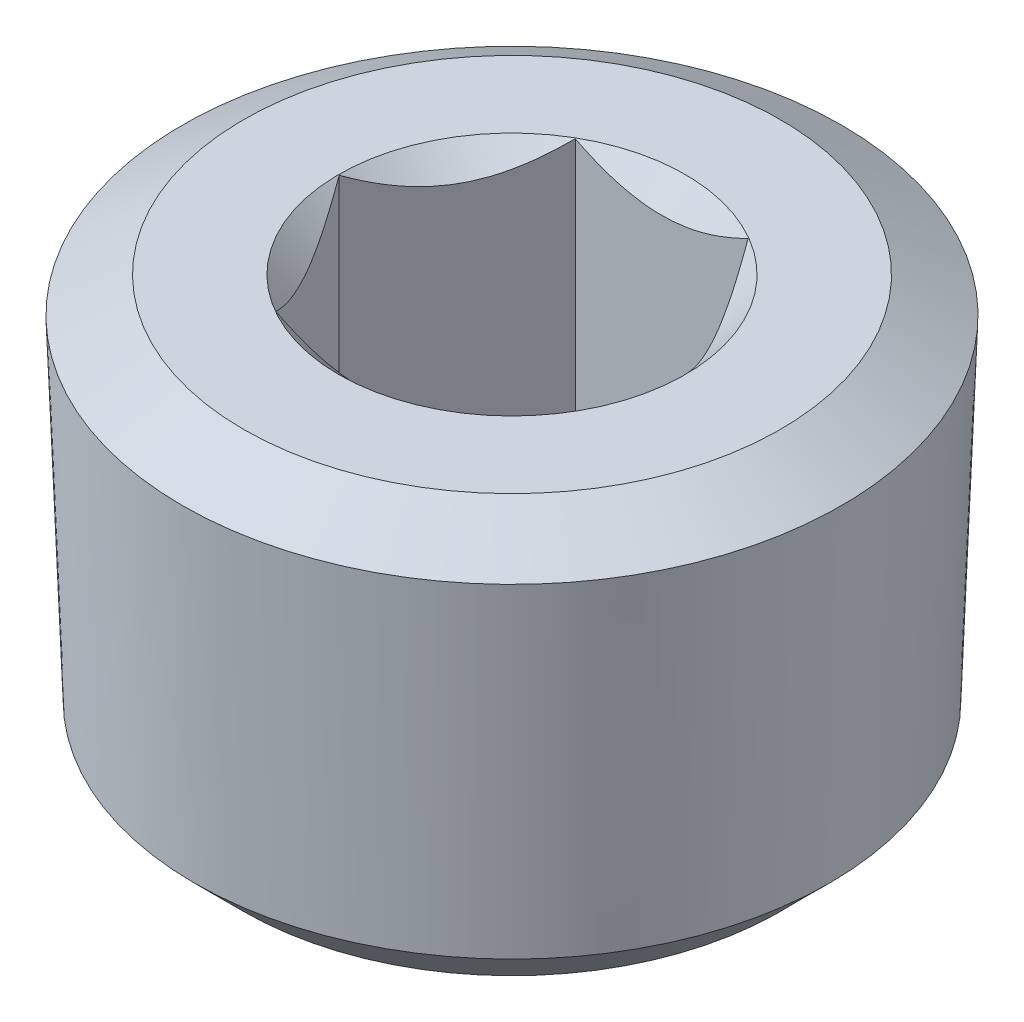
ISO-10303-21;
HEADER;
FILE_DESCRIPTION(('STEP AP214'),'2;1');
FILE_NAME('part.step','',(''),(''),'','','');
FILE_SCHEMA(('AUTOMOTIVE_DESIGN { 1 0 10303 214 1 1 1 1 }'));
ENDSEC;
DATA;
#1=APPLICATION_CONTEXT('core data for automotive mechanical design processes');
#2=APPLICATION_PROTOCOL_DEFINITION('international standard','automotive_design',2000,#1);
#3=PRODUCT_CONTEXT('',#1,'mechanical');
#4=PRODUCT('Part','Part','',(#3));
#5=PRODUCT_RELATED_PRODUCT_CATEGORY('part','',(#4));
#6=PRODUCT_DEFINITION_FORMATION('','',#4);
#7=PRODUCT_DEFINITION_CONTEXT('part definition',#1,'design');
#8=PRODUCT_DEFINITION('design','',#6,#7);
#9=PRODUCT_DEFINITION_SHAPE('','',#8);
#10=(LENGTH_UNIT() NAMED_UNIT(*) SI_UNIT(.MILLI.,.METRE.));
#11=(NAMED_UNIT(*) PLANE_ANGLE_UNIT() SI_UNIT($,.RADIAN.));
#12=(NAMED_UNIT(*) SI_UNIT($,.STERADIAN.) SOLID_ANGLE_UNIT());
#13=UNCERTAINTY_MEASURE_WITH_UNIT(LENGTH_MEASURE(1.E-05),#10,'distance_accuracy_value','');
#14=(GEOMETRIC_REPRESENTATION_CONTEXT(3) GLOBAL_UNCERTAINTY_ASSIGNED_CONTEXT((#13)) GLOBAL_UNIT_ASSIGNED_CONTEXT((#10,
#11,#12)) REPRESENTATION_CONTEXT('',''));
#15=CARTESIAN_POINT('',(0.,0.,0.));
#16=DIRECTION('',(0.,0.,1.));
#17=DIRECTION('',(1.,0.,0.));
#18=AXIS2_PLACEMENT_3D('',#15,#16,#17);
#19=CARTESIAN_POINT('',(0.,0.,0.));
#20=DIRECTION('',(0.,1.,0.));
#21=DIRECTION('',(0.,0.,1.));
#22=AXIS2_PLACEMENT_3D('',#19,#20,#21);
#23=PLANE('',#22);
#24=CARTESIAN_POINT('',(0.,0.,0.));
#25=DIRECTION('',(0.,1.,0.));
#26=DIRECTION('',(0.,0.,1.));
#27=AXIS2_PLACEMENT_3D('',#24,#25,#26);
#28=CIRCLE('',#27,5.588);
#29=CARTESIAN_POINT('',(0.,0.,5.588));
#30=VERTEX_POINT('',#29);
#31=EDGE_CURVE('E238',#30,#30,#28,.T.);
#32=ORIENTED_EDGE('',*,*,#31,.F.);
#33=EDGE_LOOP('',(#32));
#34=FACE_BOUND('',#33,.T.);
#35=CARTESIAN_POINT('',(0.,0.,0.));
#36=DIRECTION('',(0.,1.,0.));
#37=DIRECTION('',(0.,0.,1.));
#38=AXIS2_PLACEMENT_3D('',#35,#36,#37);
#39=CIRCLE('',#38,8.6531941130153);
#40=CARTESIAN_POINT('',(0.,0.,8.6531941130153));
#41=VERTEX_POINT('',#40);
#42=EDGE_CURVE('E12',#41,#41,#39,.T.);
#43=ORIENTED_EDGE('',*,*,#42,.T.);
#44=EDGE_LOOP('',(#43));
#45=FACE_BOUND('',#44,.T.);
#46=ADVANCED_FACE('F33',(#34,#45),#23,.T.);
#47=CARTESIAN_POINT('',(0.,0.,0.));
#48=DIRECTION('',(0.,-1.,0.));
#49=DIRECTION('',(0.,0.,-1.));
#50=AXIS2_PLACEMENT_3D('',#47,#48,#49);
#51=CONICAL_SURFACE('',#50,8.6531941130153,1.0471975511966);
#52=CARTESIAN_POINT('',(0.,-1.13926782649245,0.));
#53=DIRECTION('',(0.,1.,0.));
#54=DIRECTION('',(0.,0.,1.));
#55=AXIS2_PLACEMENT_3D('',#52,#53,#54);
#56=CIRCLE('',#55,10.6264638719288);
#57=CARTESIAN_POINT('',(0.,-1.13926782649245,10.6264638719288));
#58=VERTEX_POINT('',#57);
#59=EDGE_CURVE('E40',#58,#58,#56,.T.);
#60=ORIENTED_EDGE('',*,*,#59,.T.);
#61=EDGE_LOOP('',(#60));
#62=FACE_BOUND('',#61,.T.);
#63=ORIENTED_EDGE('',*,*,#42,.F.);
#64=EDGE_LOOP('',(#63));
#65=FACE_BOUND('',#64,.T.);
#66=ADVANCED_FACE('F228',(#62,#65),#51,.T.);
#67=CARTESIAN_POINT('',(0.,-1.13926782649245,0.));
#68=DIRECTION('',(0.,1.,0.));
#69=DIRECTION('',(0.,0.,1.));
#70=AXIS2_PLACEMENT_3D('',#67,#68,#69);
#71=CONICAL_SURFACE('',#70,10.6264638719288,0.0364424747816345);
#72=CARTESIAN_POINT('',(0.,-11.8803346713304,0.));
#73=DIRECTION('',(0.,1.,0.));
#74=DIRECTION('',(0.,0.,1.));
#75=AXIS2_PLACEMENT_3D('',#72,#73,#74);
#76=CIRCLE('',#75,10.2348594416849);
#77=CARTESIAN_POINT('',(0.,-11.8803346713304,10.2348594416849));
#78=VERTEX_POINT('',#77);
#79=EDGE_CURVE('E246',#78,#78,#76,.T.);
#80=ORIENTED_EDGE('',*,*,#79,.T.);
#81=EDGE_LOOP('',(#80));
#82=FACE_BOUND('',#81,.T.);
#83=ORIENTED_EDGE('',*,*,#59,.F.);
#84=EDGE_LOOP('',(#83));
#85=FACE_BOUND('',#84,.T.);
#86=ADVANCED_FACE('F233',(#82,#85),#71,.T.);
#87=CARTESIAN_POINT('',(0.,-11.8803346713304,0.));
#88=DIRECTION('',(0.,1.,0.));
#89=DIRECTION('',(0.,0.,1.));
#90=AXIS2_PLACEMENT_3D('',#87,#88,#89);
#91=CONICAL_SURFACE('',#90,10.2348594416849,0.785398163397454);
#92=CARTESIAN_POINT('',(0.,-13.462,0.));
#93=DIRECTION('',(0.,1.,0.));
#94=DIRECTION('',(0.,0.,1.));
#95=AXIS2_PLACEMENT_3D('',#92,#93,#94);
#96=CIRCLE('',#95,8.6531941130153);
#97=CARTESIAN_POINT('',(0.,-13.462,8.6531941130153));
#98=VERTEX_POINT('',#97);
#99=EDGE_CURVE('E242',#98,#98,#96,.T.);
#100=ORIENTED_EDGE('',*,*,#99,.T.);
#101=EDGE_LOOP('',(#100));
#102=FACE_BOUND('',#101,.T.);
#103=ORIENTED_EDGE('',*,*,#79,.F.);
#104=EDGE_LOOP('',(#103));
#105=FACE_BOUND('',#104,.T.);
#106=ADVANCED_FACE('F257',(#102,#105),#91,.T.);
#107=CARTESIAN_POINT('',(-8.6531941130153,-13.462,0.));
#108=DIRECTION('',(0.,-1.,0.));
#109=DIRECTION('',(0.,0.,-1.));
#110=AXIS2_PLACEMENT_3D('',#107,#108,#109);
#111=PLANE('',#110);
#112=ORIENTED_EDGE('',*,*,#99,.F.);
#113=EDGE_LOOP('',(#112));
#114=FACE_BOUND('',#113,.T.);
#115=ADVANCED_FACE('F175',(#114),#111,.T.);
#116=CARTESIAN_POINT('',(0.,0.,0.));
#117=DIRECTION('',(0.,1.,0.));
#118=DIRECTION('',(0.,0.,1.));
#119=AXIS2_PLACEMENT_3D('',#116,#117,#118);
#120=CONICAL_SURFACE('',#119,5.588,0.785398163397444);
#121=CARTESIAN_POINT('',(-5.82098732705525,1.97336029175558,4.826));
#122=CARTESIAN_POINT('',(-5.68037895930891,1.86513957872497,4.826));
#123=CARTESIAN_POINT('',(-5.53901367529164,1.75788686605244,4.826));
#124=CARTESIAN_POINT('',(-5.25445964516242,1.54575989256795,4.826));
#125=CARTESIAN_POINT('',(-5.11127047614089,1.44088619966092,4.826));
#126=CARTESIAN_POINT('',(-4.82171273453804,1.23321340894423,4.826));
#127=CARTESIAN_POINT('',(-4.67532815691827,1.13043655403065,4.826));
#128=CARTESIAN_POINT('',(-4.3801239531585,0.928453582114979,4.826));
#129=CARTESIAN_POINT('',(-4.23130449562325,0.829247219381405,4.826));
#130=CARTESIAN_POINT('',(-3.92127070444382,0.62905260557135,4.826));
#131=CARTESIAN_POINT('',(-3.75986976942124,0.528351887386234,4.826));
#132=CARTESIAN_POINT('',(-3.43327724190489,0.333192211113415,4.826));
#133=CARTESIAN_POINT('',(-3.26808501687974,0.238734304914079,4.826));
#134=CARTESIAN_POINT('',(-2.93386328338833,0.0580712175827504,4.826));
#135=CARTESIAN_POINT('',(-2.76484697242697,-0.0281581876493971,4.826));
#136=CARTESIAN_POINT('',(-2.42203255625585,-0.190432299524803,4.826));
#137=CARTESIAN_POINT('',(-2.24823675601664,-0.26648181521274,4.826));
#138=CARTESIAN_POINT('',(-1.9129593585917,-0.398742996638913,4.826));
#139=CARTESIAN_POINT('',(-1.75196353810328,-0.456173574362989,4.826));
#140=CARTESIAN_POINT('',(-1.42586489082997,-0.558148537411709,4.826));
#141=CARTESIAN_POINT('',(-1.26076180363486,-0.602692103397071,4.826));
#142=CARTESIAN_POINT('',(-0.930313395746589,-0.675737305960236,4.826));
#143=CARTESIAN_POINT('',(-0.765033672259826,-0.704530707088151,4.826));
#144=CARTESIAN_POINT('',(-0.432413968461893,-0.745473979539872,4.826));
#145=CARTESIAN_POINT('',(-0.265074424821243,-0.757627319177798,4.826));
#146=CARTESIAN_POINT('',(0.0626058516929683,-0.764252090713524,4.826));
#147=CARTESIAN_POINT('',(0.222931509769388,-0.759475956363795,4.826));
#148=CARTESIAN_POINT('',(0.542334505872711,-0.73423422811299,4.826));
#149=CARTESIAN_POINT('',(0.701411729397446,-0.713767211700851,4.826));
#150=CARTESIAN_POINT('',(1.01986275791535,-0.657954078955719,4.826));
#151=CARTESIAN_POINT('',(1.17918969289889,-0.622345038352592,4.826));
#152=CARTESIAN_POINT('',(1.49433390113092,-0.538225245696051,4.826));
#153=CARTESIAN_POINT('',(1.65015137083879,-0.489715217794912,4.826));
#154=CARTESIAN_POINT('',(1.96673903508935,-0.378863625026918,4.826));
#155=CARTESIAN_POINT('',(2.12728598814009,-0.315891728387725,4.826));
#156=CARTESIAN_POINT('',(2.44425109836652,-0.180218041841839,4.826));
#157=CARTESIAN_POINT('',(2.60066735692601,-0.107511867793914,4.826));
#158=CARTESIAN_POINT('',(2.91010924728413,0.0459062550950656,4.826));
#159=CARTESIAN_POINT('',(3.06312255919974,0.12664285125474,4.826));
#160=CARTESIAN_POINT('',(3.36564324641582,0.294345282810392,4.826));
#161=CARTESIAN_POINT('',(3.51515115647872,0.38131015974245,4.826));
#162=CARTESIAN_POINT('',(3.80381290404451,0.555835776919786,4.826));
#163=CARTESIAN_POINT('',(3.94311348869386,0.643155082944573,4.826));
#164=CARTESIAN_POINT('',(4.21932134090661,0.821511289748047,4.826));
#165=CARTESIAN_POINT('',(4.35622842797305,0.912548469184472,4.826));
#166=CARTESIAN_POINT('',(4.62686190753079,1.0969365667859,4.826));
#167=CARTESIAN_POINT('',(4.76060501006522,1.19026304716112,4.826));
#168=CARTESIAN_POINT('',(5.02625631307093,1.37941840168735,4.826));
#169=CARTESIAN_POINT('',(5.15816500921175,1.47524657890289,4.826));
#170=CARTESIAN_POINT('',(5.28930417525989,1.57209878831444,4.826));
#171=B_SPLINE_CURVE_WITH_KNOTS('',3,(#121,#122,#123,#124,#125,#126,#127,#128,#129,#130,#131,
#132,#133,#134,#135,#136,#137,#138,#139,#140,#141,#142,#143,#144,#145,#146,#147,#148,#149,#150,
#151,#152,#153,#154,#155,#156,#157,#158,#159,#160,#161,#162,#163,#164,#165,#166,#167,#168,#169,
#170),.UNSPECIFIED.,.F.,.F.,(4,2,2,2,2,2,2,2,2,2,2,2,2,2,2,2,2,2,2,2,2,2,2,2,4),(0.,
0.532308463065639,1.06474268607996,1.60128394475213,2.13778820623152,2.70839310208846,
3.27909389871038,3.8480591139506,4.41675459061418,4.92911037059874,5.44149871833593,
5.94404277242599,6.44648206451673,6.92687576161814,7.40731301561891,7.89645698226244,
8.38557349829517,8.90254275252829,9.41974562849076,9.93858801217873,10.4573507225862,
10.9504993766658,11.4436850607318,11.932911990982,12.4220040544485),.UNSPECIFIED.);
#172=CARTESIAN_POINT('',(2.78629239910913,-0.0154152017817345,4.826));
#173=VERTEX_POINT('',#172);
#174=CARTESIAN_POINT('',(-2.78629239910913,-0.0154152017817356,4.826));
#175=VERTEX_POINT('',#174);
#176=EDGE_CURVE('E47',#173,#175,#171,.F.);
#177=ORIENTED_EDGE('',*,*,#176,.T.);
#178=CARTESIAN_POINT('',(-2.78617692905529,-0.0152997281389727,4.8262));
#179=CARTESIAN_POINT('',(-2.83408610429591,-0.0632046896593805,4.74321887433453));
#180=CARTESIAN_POINT('',(-2.88236353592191,-0.109639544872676,4.65959990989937));
#181=CARTESIAN_POINT('',(-2.97972716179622,-0.199121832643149,4.49096116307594));
#182=CARTESIAN_POINT('',(-3.02881378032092,-0.242167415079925,4.4059406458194));
#183=CARTESIAN_POINT('',(-3.17785183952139,-0.365916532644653,4.14779915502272));
#184=CARTESIAN_POINT('',(-3.27906498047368,-0.440704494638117,3.97249285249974));
#185=CARTESIAN_POINT('',(-3.48316938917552,-0.568773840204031,3.61897364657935));
#186=CARTESIAN_POINT('',(-3.58600848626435,-0.622377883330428,3.44085110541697));
#187=CARTESIAN_POINT('',(-3.74195789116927,-0.684384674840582,3.17073881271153));
#188=CARTESIAN_POINT('',(-3.794170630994,-0.701978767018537,3.08030369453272));
#189=CARTESIAN_POINT('',(-3.8990382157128,-0.730635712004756,2.89866770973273));
#190=CARTESIAN_POINT('',(-3.95169299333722,-0.741699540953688,2.80746695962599));
#191=CARTESIAN_POINT('',(-4.08000416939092,-0.760249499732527,2.58522548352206));
#192=CARTESIAN_POINT('',(-4.15579881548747,-0.764141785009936,2.45394530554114));
#193=CARTESIAN_POINT('',(-4.30725151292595,-0.757609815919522,2.19162153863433));
#194=CARTESIAN_POINT('',(-4.38290950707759,-0.747180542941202,2.06057804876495));
#195=CARTESIAN_POINT('',(-4.53351221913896,-0.71262022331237,1.79972649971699));
#196=CARTESIAN_POINT('',(-4.60845604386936,-0.688473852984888,1.66991998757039));
#197=CARTESIAN_POINT('',(-4.75705559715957,-0.627792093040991,1.41253801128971));
#198=CARTESIAN_POINT('',(-4.8307114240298,-0.591257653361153,1.28496237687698));
#199=CARTESIAN_POINT('',(-4.96146614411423,-0.51609361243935,1.0584885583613));
#200=CARTESIAN_POINT('',(-5.01885452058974,-0.479440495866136,0.959088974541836));
#201=CARTESIAN_POINT('',(-5.13260104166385,-0.40022749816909,0.762074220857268));
#202=CARTESIAN_POINT('',(-5.18895915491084,-0.357667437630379,0.664459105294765));
#203=CARTESIAN_POINT('',(-5.30046764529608,-0.267594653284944,0.471320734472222));
#204=CARTESIAN_POINT('',(-5.35562119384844,-0.220097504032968,0.375791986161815));
#205=CARTESIAN_POINT('',(-5.46490695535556,-0.120774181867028,0.186503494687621));
#206=CARTESIAN_POINT('',(-5.5190397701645,-0.0689506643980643,0.092742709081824));
#207=CARTESIAN_POINT('',(-5.5727002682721,-0.0152997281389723,-0.000199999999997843));
#208=B_SPLINE_CURVE_WITH_KNOTS('',3,(#178,#179,#180,#181,#182,#183,#184,#185,#186,#187,#188,
#189,#190,#191,#192,#193,#194,#195,#196,#197,#198,#199,#200,#201,#202,#203,#204,#205,#206,#207),
.UNSPECIFIED.,.F.,.F.,(4,2,2,2,2,2,2,2,2,2,2,2,2,2,4),(0.,0.321360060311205,0.642894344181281,
1.28943446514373,1.92570770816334,2.24322028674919,2.56068539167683,3.01489632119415,
3.46926645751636,3.92414518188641,4.37898903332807,4.74028088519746,5.10158371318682,
5.46177950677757,5.82175582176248),.UNSPECIFIED.);
#209=CARTESIAN_POINT('',(-5.57258479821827,-0.0154152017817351,0.));
#210=VERTEX_POINT('',#209);
#211=EDGE_CURVE('E119',#175,#210,#208,.T.);
#212=ORIENTED_EDGE('',*,*,#211,.T.);
#213=CARTESIAN_POINT('',(-5.5727002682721,-0.0152997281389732,0.000200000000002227));
#214=CARTESIAN_POINT('',(-5.52479109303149,-0.0632046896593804,-0.0827811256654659));
#215=CARTESIAN_POINT('',(-5.47651366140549,-0.109639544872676,-0.16640009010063));
#216=CARTESIAN_POINT('',(-5.37915003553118,-0.199121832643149,-0.335038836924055));
#217=CARTESIAN_POINT('',(-5.33006341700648,-0.242167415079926,-0.420059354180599));
#218=CARTESIAN_POINT('',(-5.18102535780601,-0.365916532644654,-0.678200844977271));
#219=CARTESIAN_POINT('',(-5.07981221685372,-0.440704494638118,-0.853507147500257));
#220=CARTESIAN_POINT('',(-4.87570780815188,-0.568773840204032,-1.20702635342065));
#221=CARTESIAN_POINT('',(-4.77286871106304,-0.622377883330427,-1.38514889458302));
#222=CARTESIAN_POINT('',(-4.61691930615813,-0.684384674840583,-1.65526118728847));
#223=CARTESIAN_POINT('',(-4.5647065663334,-0.701978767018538,-1.74569630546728));
#224=CARTESIAN_POINT('',(-4.4598389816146,-0.730635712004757,-1.92733229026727));
#225=CARTESIAN_POINT('',(-4.40718420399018,-0.741699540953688,-2.01853304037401));
#226=CARTESIAN_POINT('',(-4.27887302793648,-0.760249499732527,-2.24077451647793));
#227=CARTESIAN_POINT('',(-4.20307838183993,-0.764141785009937,-2.37205469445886));
#228=CARTESIAN_POINT('',(-4.05162568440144,-0.757609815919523,-2.63437846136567));
#229=CARTESIAN_POINT('',(-3.97596769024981,-0.747180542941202,-2.76542195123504));
#230=CARTESIAN_POINT('',(-3.82536497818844,-0.71262022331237,-3.02627350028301));
#231=CARTESIAN_POINT('',(-3.75042115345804,-0.688473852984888,-3.15608001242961));
#232=CARTESIAN_POINT('',(-3.60182160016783,-0.627792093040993,-3.41346198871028));
#233=CARTESIAN_POINT('',(-3.5281657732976,-0.591257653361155,-3.54103762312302));
#234=CARTESIAN_POINT('',(-3.39741105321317,-0.516093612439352,-3.76751144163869));
#235=CARTESIAN_POINT('',(-3.34002267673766,-0.479440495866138,-3.86691102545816));
#236=CARTESIAN_POINT('',(-3.22627615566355,-0.400227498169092,-4.06392577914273));
#237=CARTESIAN_POINT('',(-3.16991804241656,-0.357667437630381,-4.16154089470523));
#238=CARTESIAN_POINT('',(-3.05840955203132,-0.267594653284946,-4.35467926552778));
#239=CARTESIAN_POINT('',(-3.00325600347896,-0.220097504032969,-4.45020801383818));
#240=CARTESIAN_POINT('',(-2.89397024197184,-0.120774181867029,-4.63949650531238));
#241=CARTESIAN_POINT('',(-2.8398374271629,-0.0689506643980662,-4.73325729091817));
#242=CARTESIAN_POINT('',(-2.7861769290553,-0.0152997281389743,-4.8262));
#243=B_SPLINE_CURVE_WITH_KNOTS('',3,(#213,#214,#215,#216,#217,#218,#219,#220,#221,#222,#223,
#224,#225,#226,#227,#228,#229,#230,#231,#232,#233,#234,#235,#236,#237,#238,#239,#240,#241,#242),
.UNSPECIFIED.,.F.,.F.,(4,2,2,2,2,2,2,2,2,2,2,2,2,2,4),(0.,0.321360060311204,0.642894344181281,
1.28943446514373,1.92570770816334,2.24322028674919,2.56068539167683,3.01489632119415,
3.46926645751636,3.92414518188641,4.37898903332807,4.74028088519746,5.10158371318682,
5.46177950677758,5.82175582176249),.UNSPECIFIED.);
#244=CARTESIAN_POINT('',(-2.78629239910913,-0.0154152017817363,-4.826));
#245=VERTEX_POINT('',#244);
#246=EDGE_CURVE('E197',#210,#245,#243,.T.);
#247=ORIENTED_EDGE('',*,*,#246,.T.);
#248=CARTESIAN_POINT('',(-5.82098732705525,1.97336029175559,-4.826));
#249=CARTESIAN_POINT('',(-5.68037895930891,1.86513957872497,-4.826));
#250=CARTESIAN_POINT('',(-5.53901367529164,1.75788686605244,-4.826));
#251=CARTESIAN_POINT('',(-5.25445964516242,1.54575989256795,-4.826));
#252=CARTESIAN_POINT('',(-5.11127047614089,1.44088619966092,-4.826));
#253=CARTESIAN_POINT('',(-4.82171273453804,1.23321340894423,-4.826));
#254=CARTESIAN_POINT('',(-4.67532815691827,1.13043655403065,-4.826));
#255=CARTESIAN_POINT('',(-4.3801239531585,0.928453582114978,-4.826));
#256=CARTESIAN_POINT('',(-4.23130449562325,0.829247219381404,-4.826));
#257=CARTESIAN_POINT('',(-3.92127070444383,0.629052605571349,-4.826));
#258=CARTESIAN_POINT('',(-3.75986976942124,0.528351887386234,-4.826));
#259=CARTESIAN_POINT('',(-3.43327724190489,0.333192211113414,-4.826));
#260=CARTESIAN_POINT('',(-3.26808501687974,0.238734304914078,-4.826));
#261=CARTESIAN_POINT('',(-2.93386328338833,0.0580712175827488,-4.826));
#262=CARTESIAN_POINT('',(-2.76484697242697,-0.0281581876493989,-4.826));
#263=CARTESIAN_POINT('',(-2.42203255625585,-0.190432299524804,-4.826));
#264=CARTESIAN_POINT('',(-2.24823675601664,-0.266481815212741,-4.826));
#265=CARTESIAN_POINT('',(-1.9129593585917,-0.398742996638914,-4.826));
#266=CARTESIAN_POINT('',(-1.75196353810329,-0.45617357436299,-4.826));
#267=CARTESIAN_POINT('',(-1.42586489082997,-0.558148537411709,-4.826));
#268=CARTESIAN_POINT('',(-1.26076180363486,-0.602692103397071,-4.826));
#269=CARTESIAN_POINT('',(-0.930313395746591,-0.675737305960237,-4.826));
#270=CARTESIAN_POINT('',(-0.765033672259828,-0.704530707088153,-4.826));
#271=CARTESIAN_POINT('',(-0.432413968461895,-0.745473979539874,-4.826));
#272=CARTESIAN_POINT('',(-0.265074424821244,-0.757627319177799,-4.826));
#273=CARTESIAN_POINT('',(0.0626058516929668,-0.764252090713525,-4.826));
#274=CARTESIAN_POINT('',(0.222931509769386,-0.759475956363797,-4.826));
#275=CARTESIAN_POINT('',(0.542334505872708,-0.734234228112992,-4.826));
#276=CARTESIAN_POINT('',(0.701411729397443,-0.713767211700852,-4.826));
#277=CARTESIAN_POINT('',(1.01986275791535,-0.657954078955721,-4.826));
#278=CARTESIAN_POINT('',(1.17918969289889,-0.622345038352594,-4.826));
#279=CARTESIAN_POINT('',(1.49433390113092,-0.538225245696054,-4.826));
#280=CARTESIAN_POINT('',(1.65015137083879,-0.489715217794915,-4.826));
#281=CARTESIAN_POINT('',(1.96673903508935,-0.378863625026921,-4.826));
#282=CARTESIAN_POINT('',(2.12728598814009,-0.315891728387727,-4.826));
#283=CARTESIAN_POINT('',(2.44425109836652,-0.180218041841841,-4.826));
#284=CARTESIAN_POINT('',(2.60066735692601,-0.107511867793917,-4.826));
#285=CARTESIAN_POINT('',(2.91010924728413,0.045906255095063,-4.826));
#286=CARTESIAN_POINT('',(3.06312255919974,0.126642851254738,-4.826));
#287=CARTESIAN_POINT('',(3.36564324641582,0.29434528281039,-4.826));
#288=CARTESIAN_POINT('',(3.51515115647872,0.381310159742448,-4.826));
#289=CARTESIAN_POINT('',(3.80381290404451,0.555835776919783,-4.826));
#290=CARTESIAN_POINT('',(3.94311348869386,0.64315508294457,-4.826));
#291=CARTESIAN_POINT('',(4.21932134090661,0.821511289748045,-4.826));
#292=CARTESIAN_POINT('',(4.35622842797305,0.912548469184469,-4.826));
#293=CARTESIAN_POINT('',(4.62686190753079,1.09693656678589,-4.826));
#294=CARTESIAN_POINT('',(4.76060501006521,1.19026304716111,-4.826));
#295=CARTESIAN_POINT('',(5.02625631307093,1.37941840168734,-4.826));
#296=CARTESIAN_POINT('',(5.15816500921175,1.47524657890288,-4.826));
#297=CARTESIAN_POINT('',(5.28930417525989,1.57209878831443,-4.826));
#298=B_SPLINE_CURVE_WITH_KNOTS('',3,(#248,#249,#250,#251,#252,#253,#254,#255,#256,#257,#258,
#259,#260,#261,#262,#263,#264,#265,#266,#267,#268,#269,#270,#271,#272,#273,#274,#275,#276,#277,
#278,#279,#280,#281,#282,#283,#284,#285,#286,#287,#288,#289,#290,#291,#292,#293,#294,#295,#296,
#297),.UNSPECIFIED.,.F.,.F.,(4,2,2,2,2,2,2,2,2,2,2,2,2,2,2,2,2,2,2,2,2,2,2,2,4),(0.,
0.532308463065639,1.06474268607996,1.60128394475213,2.13778820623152,2.70839310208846,
3.27909389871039,3.84805911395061,4.41675459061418,4.92911037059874,5.44149871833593,
5.94404277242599,6.44648206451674,6.92687576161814,7.40731301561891,7.89645698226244,
8.38557349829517,8.90254275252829,9.41974562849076,9.93858801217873,10.4573507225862,
10.9504993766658,11.4436850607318,11.932911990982,12.4220040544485),.UNSPECIFIED.);
#299=CARTESIAN_POINT('',(2.78629239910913,-0.015415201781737,-4.826));
#300=VERTEX_POINT('',#299);
#301=EDGE_CURVE('E191',#245,#300,#298,.T.);
#302=ORIENTED_EDGE('',*,*,#301,.T.);
#303=CARTESIAN_POINT('',(2.78617692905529,-0.0152997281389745,-4.8262));
#304=CARTESIAN_POINT('',(2.83408610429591,-0.0632046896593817,-4.74321887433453));
#305=CARTESIAN_POINT('',(2.88236353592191,-0.109639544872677,-4.65959990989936));
#306=CARTESIAN_POINT('',(2.97972716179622,-0.19912183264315,-4.49096116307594));
#307=CARTESIAN_POINT('',(3.02881378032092,-0.242167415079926,-4.4059406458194));
#308=CARTESIAN_POINT('',(3.17785183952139,-0.365916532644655,-4.14779915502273));
#309=CARTESIAN_POINT('',(3.27906498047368,-0.440704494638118,-3.97249285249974));
#310=CARTESIAN_POINT('',(3.48316938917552,-0.568773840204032,-3.61897364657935));
#311=CARTESIAN_POINT('',(3.58600848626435,-0.622377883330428,-3.44085110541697));
#312=CARTESIAN_POINT('',(3.74195789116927,-0.684384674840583,-3.17073881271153));
#313=CARTESIAN_POINT('',(3.794170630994,-0.701978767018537,-3.08030369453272));
#314=CARTESIAN_POINT('',(3.8990382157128,-0.730635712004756,-2.89866770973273));
#315=CARTESIAN_POINT('',(3.95169299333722,-0.741699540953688,-2.80746695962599));
#316=CARTESIAN_POINT('',(4.08000416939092,-0.760249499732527,-2.58522548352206));
#317=CARTESIAN_POINT('',(4.15579881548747,-0.764141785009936,-2.45394530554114));
#318=CARTESIAN_POINT('',(4.30725151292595,-0.757609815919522,-2.19162153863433));
#319=CARTESIAN_POINT('',(4.38290950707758,-0.747180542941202,-2.06057804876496));
#320=CARTESIAN_POINT('',(4.53351221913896,-0.712620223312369,-1.79972649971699));
#321=CARTESIAN_POINT('',(4.60845604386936,-0.688473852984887,-1.66991998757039));
#322=CARTESIAN_POINT('',(4.75705559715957,-0.627792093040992,-1.41253801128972));
#323=CARTESIAN_POINT('',(4.8307114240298,-0.591257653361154,-1.28496237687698));
#324=CARTESIAN_POINT('',(4.96146614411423,-0.516093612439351,-1.0584885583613));
#325=CARTESIAN_POINT('',(5.01885452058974,-0.479440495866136,-0.959088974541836));
#326=CARTESIAN_POINT('',(5.13260104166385,-0.40022749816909,-0.762074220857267));
#327=CARTESIAN_POINT('',(5.18895915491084,-0.357667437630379,-0.664459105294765));
#328=CARTESIAN_POINT('',(5.30046764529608,-0.267594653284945,-0.471320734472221));
#329=CARTESIAN_POINT('',(5.35562119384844,-0.220097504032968,-0.375791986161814));
#330=CARTESIAN_POINT('',(5.46490695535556,-0.120774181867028,-0.18650349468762));
#331=CARTESIAN_POINT('',(5.5190397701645,-0.0689506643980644,-0.0927427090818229));
#332=CARTESIAN_POINT('',(5.5727002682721,-0.0152997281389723,0.000199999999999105));
#333=B_SPLINE_CURVE_WITH_KNOTS('',3,(#303,#304,#305,#306,#307,#308,#309,#310,#311,#312,#313,
#314,#315,#316,#317,#318,#319,#320,#321,#322,#323,#324,#325,#326,#327,#328,#329,#330,#331,#332),
.UNSPECIFIED.,.F.,.F.,(4,2,2,2,2,2,2,2,2,2,2,2,2,2,4),(0.,0.321360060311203,0.642894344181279,
1.28943446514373,1.92570770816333,2.24322028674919,2.56068539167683,3.01489632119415,
3.46926645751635,3.9241451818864,4.37898903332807,4.74028088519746,5.10158371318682,
5.46177950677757,5.82175582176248),.UNSPECIFIED.);
#334=CARTESIAN_POINT('',(5.57258479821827,-0.0154152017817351,0.));
#335=VERTEX_POINT('',#334);
#336=EDGE_CURVE('E185',#300,#335,#333,.T.);
#337=ORIENTED_EDGE('',*,*,#336,.T.);
#338=CARTESIAN_POINT('',(5.5727002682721,-0.0152997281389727,-0.000200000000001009));
#339=CARTESIAN_POINT('',(5.52479109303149,-0.0632046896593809,0.0827811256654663));
#340=CARTESIAN_POINT('',(5.47651366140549,-0.109639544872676,0.166400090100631));
#341=CARTESIAN_POINT('',(5.37915003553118,-0.199121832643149,0.335038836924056));
#342=CARTESIAN_POINT('',(5.33006341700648,-0.242167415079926,0.4200593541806));
#343=CARTESIAN_POINT('',(5.18102535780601,-0.365916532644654,0.678200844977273));
#344=CARTESIAN_POINT('',(5.07981221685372,-0.440704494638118,0.853507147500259));
#345=CARTESIAN_POINT('',(4.87570780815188,-0.568773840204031,1.20702635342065));
#346=CARTESIAN_POINT('',(4.77286871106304,-0.622377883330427,1.38514889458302));
#347=CARTESIAN_POINT('',(4.61691930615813,-0.684384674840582,1.65526118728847));
#348=CARTESIAN_POINT('',(4.5647065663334,-0.701978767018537,1.74569630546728));
#349=CARTESIAN_POINT('',(4.4598389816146,-0.730635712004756,1.92733229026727));
#350=CARTESIAN_POINT('',(4.40718420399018,-0.741699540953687,2.01853304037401));
#351=CARTESIAN_POINT('',(4.27887302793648,-0.760249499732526,2.24077451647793));
#352=CARTESIAN_POINT('',(4.20307838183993,-0.764141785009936,2.37205469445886));
#353=CARTESIAN_POINT('',(4.05162568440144,-0.757609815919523,2.63437846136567));
#354=CARTESIAN_POINT('',(3.97596769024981,-0.747180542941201,2.76542195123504));
#355=CARTESIAN_POINT('',(3.82536497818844,-0.712620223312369,3.026273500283));
#356=CARTESIAN_POINT('',(3.75042115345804,-0.688473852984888,3.1560800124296));
#357=CARTESIAN_POINT('',(3.60182160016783,-0.627792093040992,3.41346198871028));
#358=CARTESIAN_POINT('',(3.5281657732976,-0.591257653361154,3.54103762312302));
#359=CARTESIAN_POINT('',(3.39741105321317,-0.516093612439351,3.76751144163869));
#360=CARTESIAN_POINT('',(3.34002267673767,-0.479440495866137,3.86691102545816));
#361=CARTESIAN_POINT('',(3.22627615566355,-0.400227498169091,4.06392577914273));
#362=CARTESIAN_POINT('',(3.16991804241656,-0.35766743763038,4.16154089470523));
#363=CARTESIAN_POINT('',(3.05840955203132,-0.267594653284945,4.35467926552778));
#364=CARTESIAN_POINT('',(3.00325600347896,-0.220097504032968,4.45020801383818));
#365=CARTESIAN_POINT('',(2.89397024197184,-0.120774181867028,4.63949650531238));
#366=CARTESIAN_POINT('',(2.8398374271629,-0.0689506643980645,4.73325729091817));
#367=CARTESIAN_POINT('',(2.7861769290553,-0.0152997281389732,4.8262));
#368=B_SPLINE_CURVE_WITH_KNOTS('',3,(#338,#339,#340,#341,#342,#343,#344,#345,#346,#347,#348,
#349,#350,#351,#352,#353,#354,#355,#356,#357,#358,#359,#360,#361,#362,#363,#364,#365,#366,#367),
.UNSPECIFIED.,.F.,.F.,(4,2,2,2,2,2,2,2,2,2,2,2,2,2,4),(0.,0.321360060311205,0.642894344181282,
1.28943446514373,1.92570770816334,2.24322028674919,2.56068539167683,3.01489632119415,
3.46926645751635,3.9241451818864,4.37898903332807,4.74028088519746,5.10158371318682,
5.46177950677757,5.82175582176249),.UNSPECIFIED.);
#369=EDGE_CURVE('E162',#335,#173,#368,.T.);
#370=ORIENTED_EDGE('',*,*,#369,.T.);
#371=EDGE_LOOP('',(#177,#212,#247,#302,#337,#370));
#372=FACE_BOUND('',#371,.T.);
#373=ORIENTED_EDGE('',*,*,#31,.T.);
#374=EDGE_LOOP('',(#373));
#375=FACE_BOUND('',#374,.T.);
#376=ADVANCED_FACE('F170',(#372,#375),#120,.F.);
#377=CARTESIAN_POINT('',(-5.57258479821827,-8.89,0.));
#378=DIRECTION('',(-0.866025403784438,0.,0.5));
#379=DIRECTION('',(0.5,0.,0.866025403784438));
#380=AXIS2_PLACEMENT_3D('',#377,#378,#379);
#381=PLANE('',#380);
#382=DIRECTION('',(0.,1.,0.));
#383=VECTOR('',#382,1.);
#384=CARTESIAN_POINT('',(-2.78629239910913,-8.89,4.826));
#385=LINE('',#384,#383);
#386=CARTESIAN_POINT('',(-2.78629239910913,-8.89,4.826));
#387=VERTEX_POINT('',#386);
#388=EDGE_CURVE('E116',#387,#175,#385,.T.);
#389=ORIENTED_EDGE('',*,*,#388,.F.);
#390=DIRECTION('',(0.5,0.,0.866025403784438));
#391=VECTOR('',#390,1.);
#392=CARTESIAN_POINT('',(-5.57258479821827,-8.89,0.));
#393=LINE('',#392,#391);
#394=CARTESIAN_POINT('',(-4.1794385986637,-8.89,2.413));
#395=VERTEX_POINT('',#394);
#396=EDGE_CURVE('E103',#395,#387,#393,.T.);
#397=ORIENTED_EDGE('',*,*,#396,.F.);
#398=CARTESIAN_POINT('',(-5.57258479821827,-8.89,0.));
#399=VERTEX_POINT('',#398);
#400=EDGE_CURVE('E113',#399,#395,#393,.T.);
#401=ORIENTED_EDGE('',*,*,#400,.F.);
#402=DIRECTION('',(0.,1.,0.));
#403=VECTOR('',#402,1.);
#404=CARTESIAN_POINT('',(-5.57258479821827,-8.89,0.));
#405=LINE('',#404,#403);
#406=EDGE_CURVE('E143',#399,#210,#405,.T.);
#407=ORIENTED_EDGE('',*,*,#406,.T.);
#408=ORIENTED_EDGE('',*,*,#211,.F.);
#409=EDGE_LOOP('',(#389,#397,#401,#407,#408));
#410=FACE_BOUND('',#409,.T.);
#411=ADVANCED_FACE('F117',(#410),#381,.F.);
#412=CARTESIAN_POINT('',(-2.78629239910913,-8.89,-4.826));
#413=DIRECTION('',(-0.866025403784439,0.,-0.5));
#414=DIRECTION('',(-0.5,0.,0.866025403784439));
#415=AXIS2_PLACEMENT_3D('',#412,#413,#414);
#416=PLANE('',#415);
#417=ORIENTED_EDGE('',*,*,#406,.F.);
#418=DIRECTION('',(-0.5,0.,0.866025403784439));
#419=VECTOR('',#418,1.);
#420=CARTESIAN_POINT('',(-2.78629239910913,-8.89,-4.826));
#421=LINE('',#420,#419);
#422=CARTESIAN_POINT('',(-4.1794385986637,-8.89,-2.413));
#423=VERTEX_POINT('',#422);
#424=EDGE_CURVE('E140',#423,#399,#421,.T.);
#425=ORIENTED_EDGE('',*,*,#424,.F.);
#426=CARTESIAN_POINT('',(-2.78629239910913,-8.89,-4.826));
#427=VERTEX_POINT('',#426);
#428=EDGE_CURVE('E122',#427,#423,#421,.T.);
#429=ORIENTED_EDGE('',*,*,#428,.F.);
#430=DIRECTION('',(0.,1.,0.));
#431=VECTOR('',#430,1.);
#432=CARTESIAN_POINT('',(-2.78629239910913,-8.89,-4.826));
#433=LINE('',#432,#431);
#434=EDGE_CURVE('E145',#427,#245,#433,.T.);
#435=ORIENTED_EDGE('',*,*,#434,.T.);
#436=ORIENTED_EDGE('',*,*,#246,.F.);
#437=EDGE_LOOP('',(#417,#425,#429,#435,#436));
#438=FACE_BOUND('',#437,.T.);
#439=ADVANCED_FACE('F206',(#438),#416,.F.);
#440=CARTESIAN_POINT('',(2.78629239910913,-8.89,-4.826));
#441=DIRECTION('',(0.,0.,-1.));
#442=DIRECTION('',(-1.,0.,0.));
#443=AXIS2_PLACEMENT_3D('',#440,#441,#442);
#444=PLANE('',#443);
#445=ORIENTED_EDGE('',*,*,#434,.F.);
#446=DIRECTION('',(-1.,0.,0.));
#447=VECTOR('',#446,1.);
#448=CARTESIAN_POINT('',(2.78629239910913,-8.89,-4.826));
#449=LINE('',#448,#447);
#450=CARTESIAN_POINT('',(0.,-8.89,-4.826));
#451=VERTEX_POINT('',#450);
#452=EDGE_CURVE('E136',#451,#427,#449,.T.);
#453=ORIENTED_EDGE('',*,*,#452,.F.);
#454=CARTESIAN_POINT('',(2.78629239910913,-8.89,-4.826));
#455=VERTEX_POINT('',#454);
#456=EDGE_CURVE('E137',#455,#451,#449,.T.);
#457=ORIENTED_EDGE('',*,*,#456,.F.);
#458=DIRECTION('',(0.,1.,0.));
#459=VECTOR('',#458,1.);
#460=CARTESIAN_POINT('',(2.78629239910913,-8.89,-4.826));
#461=LINE('',#460,#459);
#462=EDGE_CURVE('E148',#455,#300,#461,.T.);
#463=ORIENTED_EDGE('',*,*,#462,.T.);
#464=ORIENTED_EDGE('',*,*,#301,.F.);
#465=EDGE_LOOP('',(#445,#453,#457,#463,#464));
#466=FACE_BOUND('',#465,.T.);
#467=ADVANCED_FACE('F210',(#466),#444,.F.);
#468=CARTESIAN_POINT('',(5.57258479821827,-8.89,0.));
#469=DIRECTION('',(0.866025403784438,0.,-0.5));
#470=DIRECTION('',(-0.5,0.,-0.866025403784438));
#471=AXIS2_PLACEMENT_3D('',#468,#469,#470);
#472=PLANE('',#471);
#473=ORIENTED_EDGE('',*,*,#462,.F.);
#474=DIRECTION('',(-0.5,0.,-0.866025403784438));
#475=VECTOR('',#474,1.);
#476=CARTESIAN_POINT('',(5.57258479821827,-8.89,0.));
#477=LINE('',#476,#475);
#478=CARTESIAN_POINT('',(4.1794385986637,-8.89,-2.413));
#479=VERTEX_POINT('',#478);
#480=EDGE_CURVE('E132',#479,#455,#477,.T.);
#481=ORIENTED_EDGE('',*,*,#480,.F.);
#482=CARTESIAN_POINT('',(5.57258479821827,-8.89,0.));
#483=VERTEX_POINT('',#482);
#484=EDGE_CURVE('E133',#483,#479,#477,.T.);
#485=ORIENTED_EDGE('',*,*,#484,.F.);
#486=DIRECTION('',(0.,1.,0.));
#487=VECTOR('',#486,1.);
#488=CARTESIAN_POINT('',(5.57258479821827,-8.89,0.));
#489=LINE('',#488,#487);
#490=EDGE_CURVE('E151',#483,#335,#489,.T.);
#491=ORIENTED_EDGE('',*,*,#490,.T.);
#492=ORIENTED_EDGE('',*,*,#336,.F.);
#493=EDGE_LOOP('',(#473,#481,#485,#491,#492));
#494=FACE_BOUND('',#493,.T.);
#495=ADVANCED_FACE('F214',(#494),#472,.F.);
#496=CARTESIAN_POINT('',(2.78629239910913,-8.89,4.826));
#497=DIRECTION('',(0.866025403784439,0.,0.5));
#498=DIRECTION('',(0.5,0.,-0.866025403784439));
#499=AXIS2_PLACEMENT_3D('',#496,#497,#498);
#500=PLANE('',#499);
#501=ORIENTED_EDGE('',*,*,#490,.F.);
#502=DIRECTION('',(0.5,0.,-0.866025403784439));
#503=VECTOR('',#502,1.);
#504=CARTESIAN_POINT('',(2.78629239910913,-8.89,4.826));
#505=LINE('',#504,#503);
#506=CARTESIAN_POINT('',(4.1794385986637,-8.89,2.413));
#507=VERTEX_POINT('',#506);
#508=EDGE_CURVE('E128',#507,#483,#505,.T.);
#509=ORIENTED_EDGE('',*,*,#508,.F.);
#510=CARTESIAN_POINT('',(2.78629239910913,-8.89,4.826));
#511=VERTEX_POINT('',#510);
#512=EDGE_CURVE('E55',#511,#507,#505,.T.);
#513=ORIENTED_EDGE('',*,*,#512,.F.);
#514=DIRECTION('',(0.,1.,0.));
#515=VECTOR('',#514,1.);
#516=CARTESIAN_POINT('',(2.78629239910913,-8.89,4.826));
#517=LINE('',#516,#515);
#518=EDGE_CURVE('E121',#511,#173,#517,.T.);
#519=ORIENTED_EDGE('',*,*,#518,.T.);
#520=ORIENTED_EDGE('',*,*,#369,.F.);
#521=EDGE_LOOP('',(#501,#509,#513,#519,#520));
#522=FACE_BOUND('',#521,.T.);
#523=ADVANCED_FACE('F218',(#522),#500,.F.);
#524=CARTESIAN_POINT('',(-2.78629239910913,-8.89,4.826));
#525=DIRECTION('',(0.,0.,1.));
#526=DIRECTION('',(1.,0.,0.));
#527=AXIS2_PLACEMENT_3D('',#524,#525,#526);
#528=PLANE('',#527);
#529=ORIENTED_EDGE('',*,*,#518,.F.);
#530=DIRECTION('',(1.,0.,0.));
#531=VECTOR('',#530,1.);
#532=CARTESIAN_POINT('',(-2.78629239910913,-8.89,4.826));
#533=LINE('',#532,#531);
#534=CARTESIAN_POINT('',(0.,-8.89,4.826));
#535=VERTEX_POINT('',#534);
#536=EDGE_CURVE('E127',#535,#511,#533,.T.);
#537=ORIENTED_EDGE('',*,*,#536,.F.);
#538=EDGE_CURVE('E107',#387,#535,#533,.T.);
#539=ORIENTED_EDGE('',*,*,#538,.F.);
#540=ORIENTED_EDGE('',*,*,#388,.T.);
#541=ORIENTED_EDGE('',*,*,#176,.F.);
#542=EDGE_LOOP('',(#529,#537,#539,#540,#541));
#543=FACE_BOUND('',#542,.T.);
#544=ADVANCED_FACE('F126',(#543),#528,.F.);
#545=CARTESIAN_POINT('',(0.,-8.89,0.));
#546=DIRECTION('',(0.,1.,0.));
#547=DIRECTION('',(0.,0.,1.));
#548=AXIS2_PLACEMENT_3D('',#545,#546,#547);
#549=PLANE('',#548);
#550=CARTESIAN_POINT('',(0.,-8.89,0.));
#551=DIRECTION('',(0.,1.,0.));
#552=DIRECTION('',(0.,0.,1.));
#553=AXIS2_PLACEMENT_3D('',#550,#551,#552);
#554=CIRCLE('',#553,4.826);
#555=EDGE_CURVE('E109',#395,#535,#554,.T.);
#556=ORIENTED_EDGE('',*,*,#555,.F.);
#557=ORIENTED_EDGE('',*,*,#396,.T.);
#558=ORIENTED_EDGE('',*,*,#538,.T.);
#559=EDGE_LOOP('',(#556,#557,#558));
#560=FACE_BOUND('',#559,.T.);
#561=ADVANCED_FACE('F105',(#560),#549,.T.);
#562=EDGE_CURVE('E408',#423,#395,#554,.T.);
#563=ORIENTED_EDGE('',*,*,#562,.F.);
#564=ORIENTED_EDGE('',*,*,#424,.T.);
#565=ORIENTED_EDGE('',*,*,#400,.T.);
#566=EDGE_LOOP('',(#563,#564,#565));
#567=FACE_BOUND('',#566,.T.);
#568=ADVANCED_FACE('F314',(#567),#549,.T.);
#569=EDGE_CURVE('E419',#451,#423,#554,.T.);
#570=ORIENTED_EDGE('',*,*,#569,.F.);
#571=ORIENTED_EDGE('',*,*,#452,.T.);
#572=ORIENTED_EDGE('',*,*,#428,.T.);
#573=EDGE_LOOP('',(#570,#571,#572));
#574=FACE_BOUND('',#573,.T.);
#575=ADVANCED_FACE('F323',(#574),#549,.T.);
#576=EDGE_CURVE('E420',#479,#451,#554,.T.);
#577=ORIENTED_EDGE('',*,*,#576,.F.);
#578=ORIENTED_EDGE('',*,*,#480,.T.);
#579=ORIENTED_EDGE('',*,*,#456,.T.);
#580=EDGE_LOOP('',(#577,#578,#579));
#581=FACE_BOUND('',#580,.T.);
#582=ADVANCED_FACE('F332',(#581),#549,.T.);
#583=EDGE_CURVE('E249',#507,#479,#554,.T.);
#584=ORIENTED_EDGE('',*,*,#583,.F.);
#585=ORIENTED_EDGE('',*,*,#508,.T.);
#586=ORIENTED_EDGE('',*,*,#484,.T.);
#587=EDGE_LOOP('',(#584,#585,#586));
#588=FACE_BOUND('',#587,.T.);
#589=ADVANCED_FACE('F341',(#588),#549,.T.);
#590=EDGE_CURVE('E243',#535,#507,#554,.T.);
#591=ORIENTED_EDGE('',*,*,#590,.F.);
#592=ORIENTED_EDGE('',*,*,#536,.T.);
#593=ORIENTED_EDGE('',*,*,#512,.T.);
#594=EDGE_LOOP('',(#591,#592,#593));
#595=FACE_BOUND('',#594,.T.);
#596=ADVANCED_FACE('F315',(#595),#549,.T.);
#597=CARTESIAN_POINT('',(-2.71236505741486,-10.16,0.));
#598=DIRECTION('',(0.,-1.,0.));
#599=DIRECTION('',(0.,0.,-1.));
#600=AXIS2_PLACEMENT_3D('',#597,#598,#599);
#601=PLANE('',#600);
#602=CARTESIAN_POINT('',(0.,-10.16,0.));
#603=DIRECTION('',(0.,1.,0.));
#604=DIRECTION('',(0.,0.,1.));
#605=AXIS2_PLACEMENT_3D('',#602,#603,#604);
#606=CIRCLE('',#605,2.71236505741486);
#607=CARTESIAN_POINT('',(0.,-10.16,2.71236505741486));
#608=VERTEX_POINT('',#607);
#609=EDGE_CURVE('E407',#608,#608,#606,.T.);
#610=ORIENTED_EDGE('',*,*,#609,.T.);
#611=EDGE_LOOP('',(#610));
#612=FACE_BOUND('',#611,.T.);
#613=ADVANCED_FACE('F358',(#612),#601,.F.);
#614=CARTESIAN_POINT('',(0.,-8.89,0.));
#615=DIRECTION('',(0.,1.,0.));
#616=DIRECTION('',(0.,0.,1.));
#617=AXIS2_PLACEMENT_3D('',#614,#615,#616);
#618=CONICAL_SURFACE('',#617,4.826,1.02974425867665);
#619=ORIENTED_EDGE('',*,*,#609,.F.);
#620=EDGE_LOOP('',(#619));
#621=FACE_BOUND('',#620,.T.);
#622=ORIENTED_EDGE('',*,*,#590,.T.);
#623=ORIENTED_EDGE('',*,*,#583,.T.);
#624=ORIENTED_EDGE('',*,*,#576,.T.);
#625=ORIENTED_EDGE('',*,*,#569,.T.);
#626=ORIENTED_EDGE('',*,*,#562,.T.);
#627=ORIENTED_EDGE('',*,*,#555,.T.);
#628=EDGE_LOOP('',(#622,#623,#624,#625,#626,#627));
#629=FACE_BOUND('',#628,.T.);
#630=ADVANCED_FACE('F176',(#621,#629),#618,.F.);
#631=CLOSED_SHELL('',(#46,#66,#86,#106,#115,#376,#411,#439,#467,#495,#523,#544,#561,#568,#575,
#582,#589,#596,#613,#630));
#632=MANIFOLD_SOLID_BREP('B2',#631);
#633=ADVANCED_BREP_SHAPE_REPRESENTATION('',(#18,#632),#14);
#634=SHAPE_DEFINITION_REPRESENTATION(#9,#633);
ENDSEC;
END-ISO-10303-21;
